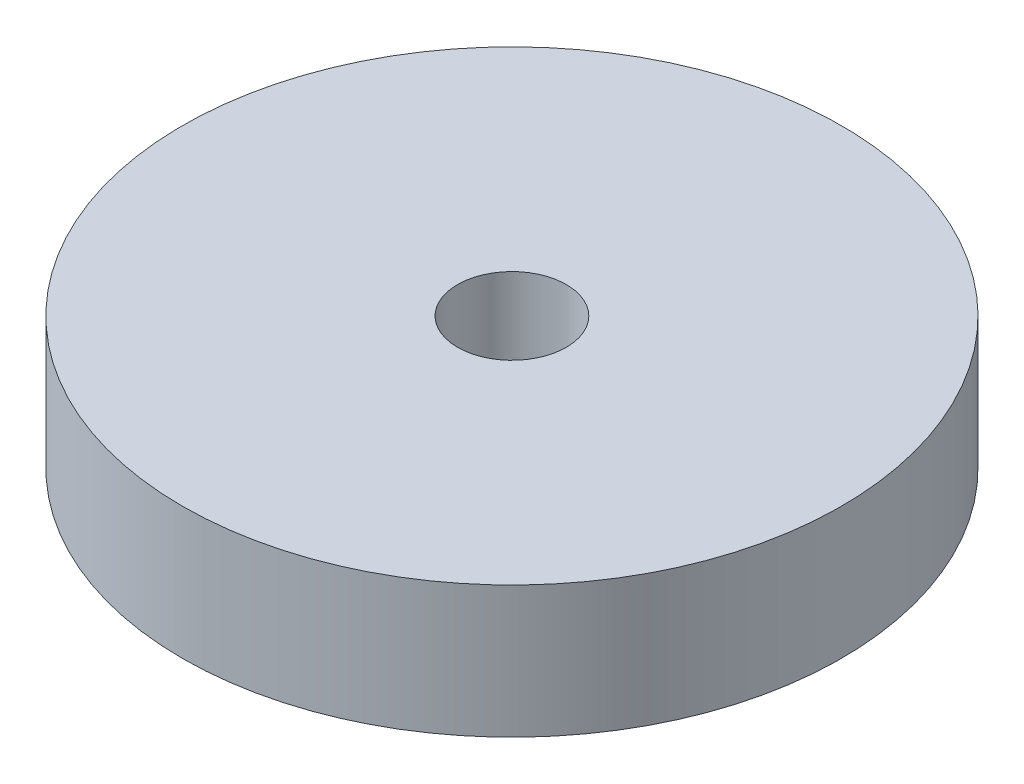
from build123d import *

# Parameters (mm, degrees)
SKETCH1_R         = 10
EXTRUDE1_DEPTH    = 4
M4_TAPPED_HOLE1_D = 3.3


with BuildPart() as part:
    # Sketch1 → Extrude1 (new body)
    with BuildSketch(Plane(origin=(0, 0, 0), x_dir=(1, 0, 0), z_dir=(0, 1, 0))):
        with Locations(Location((0, 0, 0), (0, 0, 270))):
            Circle(SKETCH1_R)
    extrude(amount=EXTRUDE1_DEPTH)

    # M4 Tapped Hole1 (through all)
    with Locations(Plane.ZX.offset(4)):
        with Locations((0, 0)):
            Hole(M4_TAPPED_HOLE1_D / 2)


solid = part.part
